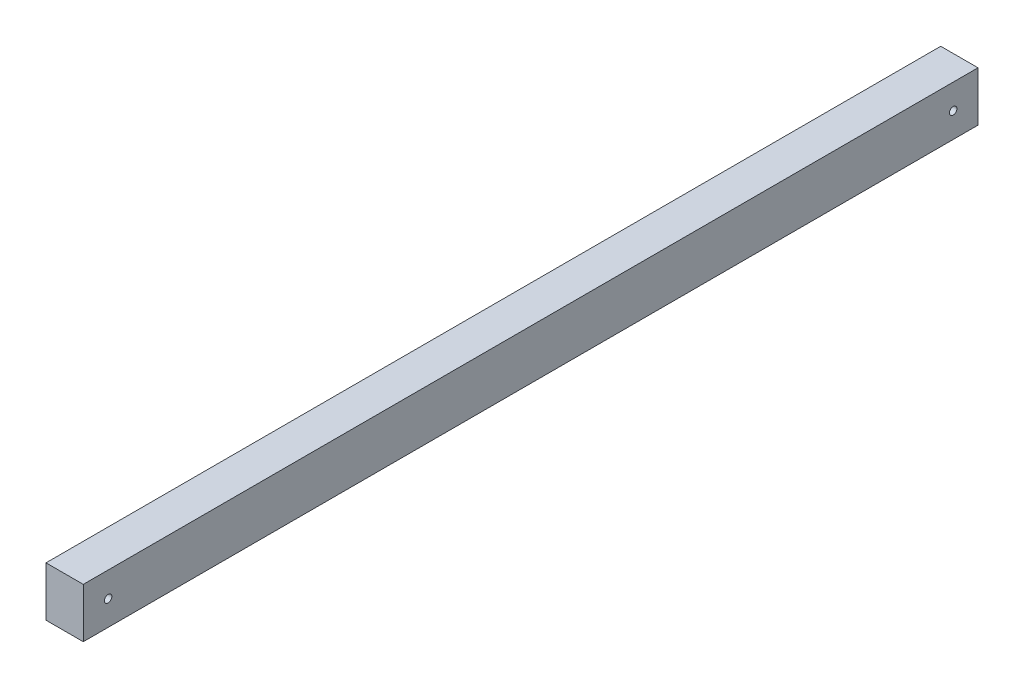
ISO-10303-21;
HEADER;
FILE_DESCRIPTION(('STEP AP214'),'2;1');
FILE_NAME('part.step','',(''),(''),'','','');
FILE_SCHEMA(('AUTOMOTIVE_DESIGN { 1 0 10303 214 1 1 1 1 }'));
ENDSEC;
DATA;
#1=APPLICATION_CONTEXT('core data for automotive mechanical design processes');
#2=APPLICATION_PROTOCOL_DEFINITION('international standard','automotive_design',2000,#1);
#3=PRODUCT_CONTEXT('',#1,'mechanical');
#4=PRODUCT('Part','Part','',(#3));
#5=PRODUCT_RELATED_PRODUCT_CATEGORY('part','',(#4));
#6=PRODUCT_DEFINITION_FORMATION('','',#4);
#7=PRODUCT_DEFINITION_CONTEXT('part definition',#1,'design');
#8=PRODUCT_DEFINITION('design','',#6,#7);
#9=PRODUCT_DEFINITION_SHAPE('','',#8);
#10=(LENGTH_UNIT() NAMED_UNIT(*) SI_UNIT(.MILLI.,.METRE.));
#11=(NAMED_UNIT(*) PLANE_ANGLE_UNIT() SI_UNIT($,.RADIAN.));
#12=(NAMED_UNIT(*) SI_UNIT($,.STERADIAN.) SOLID_ANGLE_UNIT());
#13=UNCERTAINTY_MEASURE_WITH_UNIT(LENGTH_MEASURE(1.E-05),#10,'distance_accuracy_value','');
#14=(GEOMETRIC_REPRESENTATION_CONTEXT(3) GLOBAL_UNCERTAINTY_ASSIGNED_CONTEXT((#13)) GLOBAL_UNIT_ASSIGNED_CONTEXT((#10,
#11,#12)) REPRESENTATION_CONTEXT('',''));
#15=CARTESIAN_POINT('',(0.,0.,0.));
#16=DIRECTION('',(0.,0.,1.));
#17=DIRECTION('',(1.,0.,0.));
#18=AXIS2_PLACEMENT_3D('',#15,#16,#17);
#19=CARTESIAN_POINT('',(-15.,-20.,360.));
#20=DIRECTION('',(1.,0.,0.));
#21=DIRECTION('',(0.,0.,-1.));
#22=AXIS2_PLACEMENT_3D('',#19,#20,#21);
#23=PLANE('',#22);
#24=CARTESIAN_POINT('',(-15.,0.,-340.));
#25=DIRECTION('',(1.,0.,0.));
#26=DIRECTION('',(0.,0.,1.));
#27=AXIS2_PLACEMENT_3D('',#24,#25,#26);
#28=CIRCLE('',#27,3.00000000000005);
#29=CARTESIAN_POINT('',(-15.,0.,-343.));
#30=VERTEX_POINT('',#29);
#31=EDGE_CURVE('E115',#30,#30,#28,.T.);
#32=ORIENTED_EDGE('',*,*,#31,.T.);
#33=EDGE_LOOP('',(#32));
#34=FACE_BOUND('',#33,.T.);
#35=CARTESIAN_POINT('',(-15.,0.,340.));
#36=DIRECTION('',(1.,0.,0.));
#37=DIRECTION('',(0.,0.,-1.));
#38=AXIS2_PLACEMENT_3D('',#35,#36,#37);
#39=CIRCLE('',#38,3.00000000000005);
#40=CARTESIAN_POINT('',(-15.,0.,337.));
#41=VERTEX_POINT('',#40);
#42=EDGE_CURVE('E99',#41,#41,#39,.T.);
#43=ORIENTED_EDGE('',*,*,#42,.T.);
#44=EDGE_LOOP('',(#43));
#45=FACE_BOUND('',#44,.T.);
#46=DIRECTION('',(0.,-1.,0.));
#47=VECTOR('',#46,1.);
#48=CARTESIAN_POINT('',(-15.,-20.,-360.));
#49=LINE('',#48,#47);
#50=CARTESIAN_POINT('',(-15.,20.,-360.));
#51=VERTEX_POINT('',#50);
#52=CARTESIAN_POINT('',(-15.,-20.,-360.));
#53=VERTEX_POINT('',#52);
#54=EDGE_CURVE('E96',#51,#53,#49,.T.);
#55=ORIENTED_EDGE('',*,*,#54,.T.);
#56=DIRECTION('',(0.,0.,-1.));
#57=VECTOR('',#56,1.);
#58=CARTESIAN_POINT('',(-15.,-20.,360.));
#59=LINE('',#58,#57);
#60=CARTESIAN_POINT('',(-15.,-20.,360.));
#61=VERTEX_POINT('',#60);
#62=EDGE_CURVE('E11',#61,#53,#59,.T.);
#63=ORIENTED_EDGE('',*,*,#62,.F.);
#64=DIRECTION('',(0.,-1.,0.));
#65=VECTOR('',#64,1.);
#66=CARTESIAN_POINT('',(-15.,-20.,360.));
#67=LINE('',#66,#65);
#68=CARTESIAN_POINT('',(-15.,20.,360.));
#69=VERTEX_POINT('',#68);
#70=EDGE_CURVE('E84',#69,#61,#67,.T.);
#71=ORIENTED_EDGE('',*,*,#70,.F.);
#72=DIRECTION('',(0.,0.,-1.));
#73=VECTOR('',#72,1.);
#74=CARTESIAN_POINT('',(-15.,20.,360.));
#75=LINE('',#74,#73);
#76=EDGE_CURVE('E92',#69,#51,#75,.T.);
#77=ORIENTED_EDGE('',*,*,#76,.T.);
#78=EDGE_LOOP('',(#55,#63,#71,#77));
#79=FACE_BOUND('',#78,.T.);
#80=ADVANCED_FACE('F33',(#34,#45,#79),#23,.F.);
#81=CARTESIAN_POINT('',(15.,-20.,360.));
#82=DIRECTION('',(0.,1.,0.));
#83=DIRECTION('',(0.,0.,1.));
#84=AXIS2_PLACEMENT_3D('',#81,#82,#83);
#85=PLANE('',#84);
#86=DIRECTION('',(1.,0.,0.));
#87=VECTOR('',#86,1.);
#88=CARTESIAN_POINT('',(15.,-20.,-360.));
#89=LINE('',#88,#87);
#90=CARTESIAN_POINT('',(15.,-20.,-360.));
#91=VERTEX_POINT('',#90);
#92=EDGE_CURVE('E88',#53,#91,#89,.T.);
#93=ORIENTED_EDGE('',*,*,#92,.T.);
#94=DIRECTION('',(0.,0.,-1.));
#95=VECTOR('',#94,1.);
#96=CARTESIAN_POINT('',(15.,-20.,360.));
#97=LINE('',#96,#95);
#98=CARTESIAN_POINT('',(15.,-20.,360.));
#99=VERTEX_POINT('',#98);
#100=EDGE_CURVE('E41',#99,#91,#97,.T.);
#101=ORIENTED_EDGE('',*,*,#100,.F.);
#102=DIRECTION('',(1.,0.,0.));
#103=VECTOR('',#102,1.);
#104=CARTESIAN_POINT('',(15.,-20.,360.));
#105=LINE('',#104,#103);
#106=EDGE_CURVE('E79',#61,#99,#105,.T.);
#107=ORIENTED_EDGE('',*,*,#106,.F.);
#108=ORIENTED_EDGE('',*,*,#62,.T.);
#109=EDGE_LOOP('',(#93,#101,#107,#108));
#110=FACE_BOUND('',#109,.T.);
#111=ADVANCED_FACE('F87',(#110),#85,.F.);
#112=CARTESIAN_POINT('',(15.,-20.,360.));
#113=DIRECTION('',(-1.,0.,0.));
#114=DIRECTION('',(0.,0.,1.));
#115=AXIS2_PLACEMENT_3D('',#112,#113,#114);
#116=PLANE('',#115);
#117=CARTESIAN_POINT('',(15.,0.,-340.));
#118=DIRECTION('',(1.,0.,0.));
#119=DIRECTION('',(0.,0.,1.));
#120=AXIS2_PLACEMENT_3D('',#117,#118,#119);
#121=CIRCLE('',#120,3.00000000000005);
#122=CARTESIAN_POINT('',(15.,0.,-343.));
#123=VERTEX_POINT('',#122);
#124=EDGE_CURVE('E118',#123,#123,#121,.T.);
#125=ORIENTED_EDGE('',*,*,#124,.F.);
#126=EDGE_LOOP('',(#125));
#127=FACE_BOUND('',#126,.T.);
#128=CARTESIAN_POINT('',(15.,0.,340.));
#129=DIRECTION('',(1.,0.,0.));
#130=DIRECTION('',(0.,0.,-1.));
#131=AXIS2_PLACEMENT_3D('',#128,#129,#130);
#132=CIRCLE('',#131,3.00000000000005);
#133=CARTESIAN_POINT('',(15.,0.,337.));
#134=VERTEX_POINT('',#133);
#135=EDGE_CURVE('E112',#134,#134,#132,.T.);
#136=ORIENTED_EDGE('',*,*,#135,.F.);
#137=EDGE_LOOP('',(#136));
#138=FACE_BOUND('',#137,.T.);
#139=DIRECTION('',(0.,1.,0.));
#140=VECTOR('',#139,1.);
#141=CARTESIAN_POINT('',(15.,-20.,-360.));
#142=LINE('',#141,#140);
#143=CARTESIAN_POINT('',(15.,20.,-360.));
#144=VERTEX_POINT('',#143);
#145=EDGE_CURVE('E66',#91,#144,#142,.T.);
#146=ORIENTED_EDGE('',*,*,#145,.T.);
#147=DIRECTION('',(0.,0.,-1.));
#148=VECTOR('',#147,1.);
#149=CARTESIAN_POINT('',(15.,20.,360.));
#150=LINE('',#149,#148);
#151=CARTESIAN_POINT('',(15.,20.,360.));
#152=VERTEX_POINT('',#151);
#153=EDGE_CURVE('E89',#152,#144,#150,.T.);
#154=ORIENTED_EDGE('',*,*,#153,.F.);
#155=DIRECTION('',(0.,1.,0.));
#156=VECTOR('',#155,1.);
#157=CARTESIAN_POINT('',(15.,-20.,360.));
#158=LINE('',#157,#156);
#159=EDGE_CURVE('E82',#99,#152,#158,.T.);
#160=ORIENTED_EDGE('',*,*,#159,.F.);
#161=ORIENTED_EDGE('',*,*,#100,.T.);
#162=EDGE_LOOP('',(#146,#154,#160,#161));
#163=FACE_BOUND('',#162,.T.);
#164=ADVANCED_FACE('F90',(#127,#138,#163),#116,.F.);
#165=CARTESIAN_POINT('',(15.,20.,360.));
#166=DIRECTION('',(0.,-1.,0.));
#167=DIRECTION('',(0.,0.,-1.));
#168=AXIS2_PLACEMENT_3D('',#165,#166,#167);
#169=PLANE('',#168);
#170=DIRECTION('',(-1.,0.,0.));
#171=VECTOR('',#170,1.);
#172=CARTESIAN_POINT('',(15.,20.,-360.));
#173=LINE('',#172,#171);
#174=EDGE_CURVE('E72',#144,#51,#173,.T.);
#175=ORIENTED_EDGE('',*,*,#174,.T.);
#176=ORIENTED_EDGE('',*,*,#76,.F.);
#177=DIRECTION('',(-1.,0.,0.));
#178=VECTOR('',#177,1.);
#179=CARTESIAN_POINT('',(15.,20.,360.));
#180=LINE('',#179,#178);
#181=EDGE_CURVE('E49',#152,#69,#180,.T.);
#182=ORIENTED_EDGE('',*,*,#181,.F.);
#183=ORIENTED_EDGE('',*,*,#153,.T.);
#184=EDGE_LOOP('',(#175,#176,#182,#183));
#185=FACE_BOUND('',#184,.T.);
#186=ADVANCED_FACE('F104',(#185),#169,.F.);
#187=CARTESIAN_POINT('',(0.,0.,360.));
#188=DIRECTION('',(0.,0.,1.));
#189=DIRECTION('',(1.,0.,0.));
#190=AXIS2_PLACEMENT_3D('',#187,#188,#189);
#191=PLANE('',#190);
#192=ORIENTED_EDGE('',*,*,#70,.T.);
#193=ORIENTED_EDGE('',*,*,#106,.T.);
#194=ORIENTED_EDGE('',*,*,#159,.T.);
#195=ORIENTED_EDGE('',*,*,#181,.T.);
#196=EDGE_LOOP('',(#192,#193,#194,#195));
#197=FACE_BOUND('',#196,.T.);
#198=ADVANCED_FACE('F80',(#197),#191,.T.);
#199=CARTESIAN_POINT('',(0.,0.,-360.));
#200=DIRECTION('',(0.,0.,1.));
#201=DIRECTION('',(1.,0.,0.));
#202=AXIS2_PLACEMENT_3D('',#199,#200,#201);
#203=PLANE('',#202);
#204=ORIENTED_EDGE('',*,*,#54,.F.);
#205=ORIENTED_EDGE('',*,*,#174,.F.);
#206=ORIENTED_EDGE('',*,*,#145,.F.);
#207=ORIENTED_EDGE('',*,*,#92,.F.);
#208=EDGE_LOOP('',(#204,#205,#206,#207));
#209=FACE_BOUND('',#208,.T.);
#210=ADVANCED_FACE('F107',(#209),#203,.F.);
#211=CARTESIAN_POINT('',(-15.,0.,340.));
#212=DIRECTION('',(1.,0.,0.));
#213=DIRECTION('',(0.,0.,-1.));
#214=AXIS2_PLACEMENT_3D('',#211,#212,#213);
#215=CYLINDRICAL_SURFACE('',#214,3.00000000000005);
#216=CARTESIAN_POINT('',(-15.,0.,337.));
#217=CARTESIAN_POINT('',(-14.6875,0.,337.));
#218=CARTESIAN_POINT('',(-14.375,0.,337.));
#219=CARTESIAN_POINT('',(-13.75,0.,337.));
#220=CARTESIAN_POINT('',(-13.4375,0.,337.));
#221=CARTESIAN_POINT('',(-12.8125,0.,337.));
#222=CARTESIAN_POINT('',(-12.5,0.,337.));
#223=CARTESIAN_POINT('',(-11.875,0.,337.));
#224=CARTESIAN_POINT('',(-11.5625,0.,337.));
#225=CARTESIAN_POINT('',(-10.9375,0.,337.));
#226=CARTESIAN_POINT('',(-10.625,0.,337.));
#227=CARTESIAN_POINT('',(-10.,0.,337.));
#228=CARTESIAN_POINT('',(-9.6875,0.,337.));
#229=CARTESIAN_POINT('',(-9.0625,0.,337.));
#230=CARTESIAN_POINT('',(-8.75,0.,337.));
#231=CARTESIAN_POINT('',(-8.125,0.,337.));
#232=CARTESIAN_POINT('',(-7.8125,0.,337.));
#233=CARTESIAN_POINT('',(-7.1875,0.,337.));
#234=CARTESIAN_POINT('',(-6.875,0.,337.));
#235=CARTESIAN_POINT('',(-6.25,0.,337.));
#236=CARTESIAN_POINT('',(-5.9375,0.,337.));
#237=CARTESIAN_POINT('',(-5.3125,0.,337.));
#238=CARTESIAN_POINT('',(-5.,0.,337.));
#239=CARTESIAN_POINT('',(-4.375,0.,337.));
#240=CARTESIAN_POINT('',(-4.0625,0.,337.));
#241=CARTESIAN_POINT('',(-3.4375,0.,337.));
#242=CARTESIAN_POINT('',(-3.125,0.,337.));
#243=CARTESIAN_POINT('',(-2.5,0.,337.));
#244=CARTESIAN_POINT('',(-2.1875,0.,337.));
#245=CARTESIAN_POINT('',(-1.5625,0.,337.));
#246=CARTESIAN_POINT('',(-1.25,0.,337.));
#247=CARTESIAN_POINT('',(-0.625000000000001,0.,337.));
#248=CARTESIAN_POINT('',(-0.3125,0.,337.));
#249=CARTESIAN_POINT('',(0.3125,0.,337.));
#250=CARTESIAN_POINT('',(0.624999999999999,0.,337.));
#251=CARTESIAN_POINT('',(1.25,0.,337.));
#252=CARTESIAN_POINT('',(1.5625,0.,337.));
#253=CARTESIAN_POINT('',(2.1875,0.,337.));
#254=CARTESIAN_POINT('',(2.5,0.,337.));
#255=CARTESIAN_POINT('',(3.125,0.,337.));
#256=CARTESIAN_POINT('',(3.4375,0.,337.));
#257=CARTESIAN_POINT('',(4.0625,0.,337.));
#258=CARTESIAN_POINT('',(4.375,0.,337.));
#259=CARTESIAN_POINT('',(5.,0.,337.));
#260=CARTESIAN_POINT('',(5.3125,0.,337.));
#261=CARTESIAN_POINT('',(5.9375,0.,337.));
#262=CARTESIAN_POINT('',(6.25,0.,337.));
#263=CARTESIAN_POINT('',(6.875,0.,337.));
#264=CARTESIAN_POINT('',(7.1875,0.,337.));
#265=CARTESIAN_POINT('',(7.8125,0.,337.));
#266=CARTESIAN_POINT('',(8.125,0.,337.));
#267=CARTESIAN_POINT('',(8.75,0.,337.));
#268=CARTESIAN_POINT('',(9.0625,0.,337.));
#269=CARTESIAN_POINT('',(9.6875,0.,337.));
#270=CARTESIAN_POINT('',(10.,0.,337.));
#271=CARTESIAN_POINT('',(10.625,0.,337.));
#272=CARTESIAN_POINT('',(10.9375,0.,337.));
#273=CARTESIAN_POINT('',(11.5625,0.,337.));
#274=CARTESIAN_POINT('',(11.875,0.,337.));
#275=CARTESIAN_POINT('',(12.5,0.,337.));
#276=CARTESIAN_POINT('',(12.8125,0.,337.));
#277=CARTESIAN_POINT('',(13.4375,0.,337.));
#278=CARTESIAN_POINT('',(13.75,0.,337.));
#279=CARTESIAN_POINT('',(14.375,0.,337.));
#280=CARTESIAN_POINT('',(14.6875,0.,337.));
#281=CARTESIAN_POINT('',(15.,0.,337.));
#282=B_SPLINE_CURVE_WITH_KNOTS('',3,(#216,#217,#218,#219,#220,#221,#222,#223,#224,#225,#226,
#227,#228,#229,#230,#231,#232,#233,#234,#235,#236,#237,#238,#239,#240,#241,#242,#243,#244,#245,
#246,#247,#248,#249,#250,#251,#252,#253,#254,#255,#256,#257,#258,#259,#260,#261,#262,#263,#264,
#265,#266,#267,#268,#269,#270,#271,#272,#273,#274,#275,#276,#277,#278,#279,#280,#281),
.UNSPECIFIED.,.F.,.F.,(4,2,2,2,2,2,2,2,2,2,2,2,2,2,2,2,2,2,2,2,2,2,2,2,2,2,2,2,2,2,2,2,4),(0.,
0.937499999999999,1.875,2.8125,3.75,4.6875,5.625,6.5625,7.5,8.4375,9.375,10.3125,11.25,12.1875,
13.125,14.0625,15.,15.9375,16.875,17.8125,18.75,19.6875,20.625,21.5625,22.5,23.4375,24.375,
25.3125,26.25,27.1875,28.125,29.0625,30.),.UNSPECIFIED.);
#283=EDGE_CURVE('BSEAM129',#41,#134,#282,.T.);
#284=ORIENTED_EDGE('',*,*,#42,.F.);
#285=ORIENTED_EDGE('',*,*,#135,.T.);
#286=ORIENTED_EDGE('',*,*,#283,.T.);
#287=ORIENTED_EDGE('',*,*,#283,.F.);
#288=EDGE_LOOP('',(#284,#286,#285,#287));
#289=FACE_BOUND('',#288,.T.);
#290=ADVANCED_FACE('F129',(#289),#215,.F.);
#291=CARTESIAN_POINT('',(-15.,0.,-340.));
#292=DIRECTION('',(1.,0.,0.));
#293=DIRECTION('',(0.,0.,-1.));
#294=AXIS2_PLACEMENT_3D('',#291,#292,#293);
#295=CYLINDRICAL_SURFACE('',#294,3.00000000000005);
#296=CARTESIAN_POINT('',(-15.,0.,-343.));
#297=CARTESIAN_POINT('',(-14.6875,0.,-343.));
#298=CARTESIAN_POINT('',(-14.375,0.,-343.));
#299=CARTESIAN_POINT('',(-13.75,0.,-343.));
#300=CARTESIAN_POINT('',(-13.4375,0.,-343.));
#301=CARTESIAN_POINT('',(-12.8125,0.,-343.));
#302=CARTESIAN_POINT('',(-12.5,0.,-343.));
#303=CARTESIAN_POINT('',(-11.875,0.,-343.));
#304=CARTESIAN_POINT('',(-11.5625,0.,-343.));
#305=CARTESIAN_POINT('',(-10.9375,0.,-343.));
#306=CARTESIAN_POINT('',(-10.625,0.,-343.));
#307=CARTESIAN_POINT('',(-10.,0.,-343.));
#308=CARTESIAN_POINT('',(-9.6875,0.,-343.));
#309=CARTESIAN_POINT('',(-9.0625,0.,-343.));
#310=CARTESIAN_POINT('',(-8.75,0.,-343.));
#311=CARTESIAN_POINT('',(-8.125,0.,-343.));
#312=CARTESIAN_POINT('',(-7.8125,0.,-343.));
#313=CARTESIAN_POINT('',(-7.1875,0.,-343.));
#314=CARTESIAN_POINT('',(-6.875,0.,-343.));
#315=CARTESIAN_POINT('',(-6.25,0.,-343.));
#316=CARTESIAN_POINT('',(-5.9375,0.,-343.));
#317=CARTESIAN_POINT('',(-5.3125,0.,-343.));
#318=CARTESIAN_POINT('',(-5.,0.,-343.));
#319=CARTESIAN_POINT('',(-4.375,0.,-343.));
#320=CARTESIAN_POINT('',(-4.0625,0.,-343.));
#321=CARTESIAN_POINT('',(-3.4375,0.,-343.));
#322=CARTESIAN_POINT('',(-3.125,0.,-343.));
#323=CARTESIAN_POINT('',(-2.5,0.,-343.));
#324=CARTESIAN_POINT('',(-2.1875,0.,-343.));
#325=CARTESIAN_POINT('',(-1.5625,0.,-343.));
#326=CARTESIAN_POINT('',(-1.25,0.,-343.));
#327=CARTESIAN_POINT('',(-0.625000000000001,0.,-343.));
#328=CARTESIAN_POINT('',(-0.3125,0.,-343.));
#329=CARTESIAN_POINT('',(0.3125,0.,-343.));
#330=CARTESIAN_POINT('',(0.624999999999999,0.,-343.));
#331=CARTESIAN_POINT('',(1.25,0.,-343.));
#332=CARTESIAN_POINT('',(1.5625,0.,-343.));
#333=CARTESIAN_POINT('',(2.1875,0.,-343.));
#334=CARTESIAN_POINT('',(2.5,0.,-343.));
#335=CARTESIAN_POINT('',(3.125,0.,-343.));
#336=CARTESIAN_POINT('',(3.4375,0.,-343.));
#337=CARTESIAN_POINT('',(4.0625,0.,-343.));
#338=CARTESIAN_POINT('',(4.375,0.,-343.));
#339=CARTESIAN_POINT('',(5.,0.,-343.));
#340=CARTESIAN_POINT('',(5.3125,0.,-343.));
#341=CARTESIAN_POINT('',(5.9375,0.,-343.));
#342=CARTESIAN_POINT('',(6.25,0.,-343.));
#343=CARTESIAN_POINT('',(6.875,0.,-343.));
#344=CARTESIAN_POINT('',(7.1875,0.,-343.));
#345=CARTESIAN_POINT('',(7.8125,0.,-343.));
#346=CARTESIAN_POINT('',(8.125,0.,-343.));
#347=CARTESIAN_POINT('',(8.75,0.,-343.));
#348=CARTESIAN_POINT('',(9.0625,0.,-343.));
#349=CARTESIAN_POINT('',(9.6875,0.,-343.));
#350=CARTESIAN_POINT('',(10.,0.,-343.));
#351=CARTESIAN_POINT('',(10.625,0.,-343.));
#352=CARTESIAN_POINT('',(10.9375,0.,-343.));
#353=CARTESIAN_POINT('',(11.5625,0.,-343.));
#354=CARTESIAN_POINT('',(11.875,0.,-343.));
#355=CARTESIAN_POINT('',(12.5,0.,-343.));
#356=CARTESIAN_POINT('',(12.8125,0.,-343.));
#357=CARTESIAN_POINT('',(13.4375,0.,-343.));
#358=CARTESIAN_POINT('',(13.75,0.,-343.));
#359=CARTESIAN_POINT('',(14.375,0.,-343.));
#360=CARTESIAN_POINT('',(14.6875,0.,-343.));
#361=CARTESIAN_POINT('',(15.,0.,-343.));
#362=B_SPLINE_CURVE_WITH_KNOTS('',3,(#296,#297,#298,#299,#300,#301,#302,#303,#304,#305,#306,
#307,#308,#309,#310,#311,#312,#313,#314,#315,#316,#317,#318,#319,#320,#321,#322,#323,#324,#325,
#326,#327,#328,#329,#330,#331,#332,#333,#334,#335,#336,#337,#338,#339,#340,#341,#342,#343,#344,
#345,#346,#347,#348,#349,#350,#351,#352,#353,#354,#355,#356,#357,#358,#359,#360,#361),
.UNSPECIFIED.,.F.,.F.,(4,2,2,2,2,2,2,2,2,2,2,2,2,2,2,2,2,2,2,2,2,2,2,2,2,2,2,2,2,2,2,2,4),(0.,
0.937499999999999,1.875,2.8125,3.75,4.6875,5.625,6.5625,7.5,8.4375,9.375,10.3125,11.25,12.1875,
13.125,14.0625,15.,15.9375,16.875,17.8125,18.75,19.6875,20.625,21.5625,22.5,23.4375,24.375,
25.3125,26.25,27.1875,28.125,29.0625,30.),.UNSPECIFIED.);
#363=EDGE_CURVE('BSEAM122',#30,#123,#362,.T.);
#364=ORIENTED_EDGE('',*,*,#31,.F.);
#365=ORIENTED_EDGE('',*,*,#124,.T.);
#366=ORIENTED_EDGE('',*,*,#363,.T.);
#367=ORIENTED_EDGE('',*,*,#363,.F.);
#368=EDGE_LOOP('',(#364,#366,#365,#367));
#369=FACE_BOUND('',#368,.T.);
#370=ADVANCED_FACE('F122',(#369),#295,.F.);
#371=CLOSED_SHELL('',(#80,#111,#164,#186,#198,#210,#290,#370));
#372=MANIFOLD_SOLID_BREP('B2',#371);
#373=ADVANCED_BREP_SHAPE_REPRESENTATION('',(#18,#372),#14);
#374=SHAPE_DEFINITION_REPRESENTATION(#9,#373);
ENDSEC;
END-ISO-10303-21;
